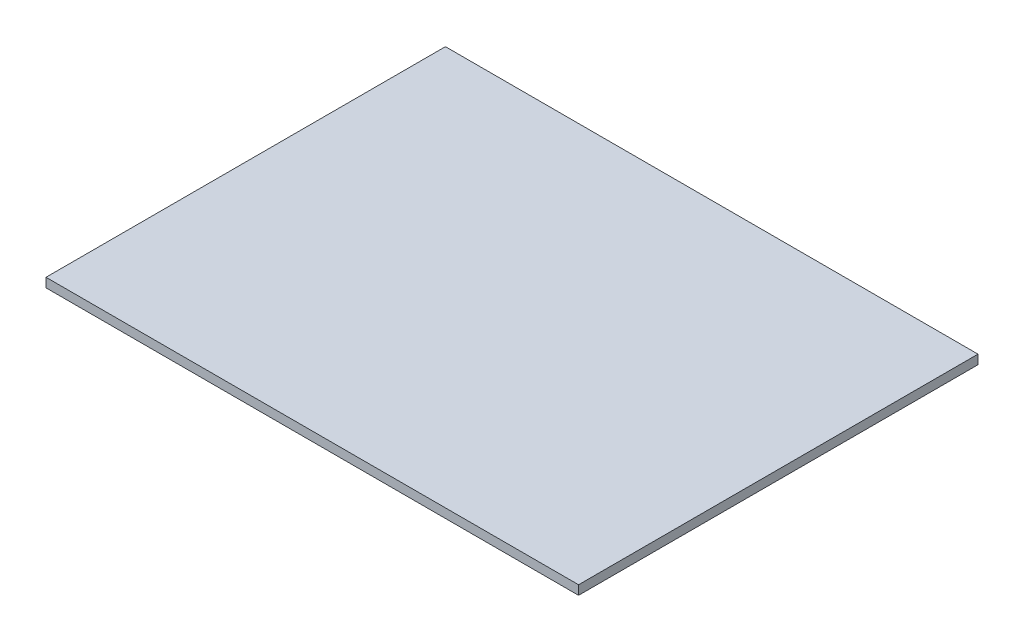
ISO-10303-21;
HEADER;
FILE_DESCRIPTION(('STEP AP214'),'2;1');
FILE_NAME('part.step','',(''),(''),'','','');
FILE_SCHEMA(('AUTOMOTIVE_DESIGN { 1 0 10303 214 1 1 1 1 }'));
ENDSEC;
DATA;
#1=APPLICATION_CONTEXT('core data for automotive mechanical design processes');
#2=APPLICATION_PROTOCOL_DEFINITION('international standard','automotive_design',2000,#1);
#3=PRODUCT_CONTEXT('',#1,'mechanical');
#4=PRODUCT('Part','Part','',(#3));
#5=PRODUCT_RELATED_PRODUCT_CATEGORY('part','',(#4));
#6=PRODUCT_DEFINITION_FORMATION('','',#4);
#7=PRODUCT_DEFINITION_CONTEXT('part definition',#1,'design');
#8=PRODUCT_DEFINITION('design','',#6,#7);
#9=PRODUCT_DEFINITION_SHAPE('','',#8);
#10=(LENGTH_UNIT() NAMED_UNIT(*) SI_UNIT(.MILLI.,.METRE.));
#11=(NAMED_UNIT(*) PLANE_ANGLE_UNIT() SI_UNIT($,.RADIAN.));
#12=(NAMED_UNIT(*) SI_UNIT($,.STERADIAN.) SOLID_ANGLE_UNIT());
#13=UNCERTAINTY_MEASURE_WITH_UNIT(LENGTH_MEASURE(1.E-05),#10,'distance_accuracy_value','');
#14=(GEOMETRIC_REPRESENTATION_CONTEXT(3) GLOBAL_UNCERTAINTY_ASSIGNED_CONTEXT((#13)) GLOBAL_UNIT_ASSIGNED_CONTEXT((#10,
#11,#12)) REPRESENTATION_CONTEXT('',''));
#15=CARTESIAN_POINT('',(0.,0.,0.));
#16=DIRECTION('',(0.,0.,1.));
#17=DIRECTION('',(1.,0.,0.));
#18=AXIS2_PLACEMENT_3D('',#15,#16,#17);
#19=CARTESIAN_POINT('',(0.,1.,0.));
#20=DIRECTION('',(1.,0.,0.));
#21=DIRECTION('',(0.,0.,-1.));
#22=AXIS2_PLACEMENT_3D('',#19,#20,#21);
#23=PLANE('',#22);
#24=DIRECTION('',(0.,0.,1.));
#25=VECTOR('',#24,1.);
#26=CARTESIAN_POINT('',(0.,0.,0.));
#27=LINE('',#26,#25);
#28=CARTESIAN_POINT('',(0.,0.,-43.5));
#29=VERTEX_POINT('',#28);
#30=CARTESIAN_POINT('',(0.,0.,0.));
#31=VERTEX_POINT('',#30);
#32=EDGE_CURVE('E96',#29,#31,#27,.T.);
#33=ORIENTED_EDGE('',*,*,#32,.T.);
#34=DIRECTION('',(0.,-1.,0.));
#35=VECTOR('',#34,1.);
#36=CARTESIAN_POINT('',(0.,1.,0.));
#37=LINE('',#36,#35);
#38=CARTESIAN_POINT('',(0.,1.,0.));
#39=VERTEX_POINT('',#38);
#40=EDGE_CURVE('E11',#39,#31,#37,.T.);
#41=ORIENTED_EDGE('',*,*,#40,.F.);
#42=DIRECTION('',(0.,0.,1.));
#43=VECTOR('',#42,1.);
#44=CARTESIAN_POINT('',(0.,1.,0.));
#45=LINE('',#44,#43);
#46=CARTESIAN_POINT('',(0.,1.,-43.5));
#47=VERTEX_POINT('',#46);
#48=EDGE_CURVE('E84',#47,#39,#45,.T.);
#49=ORIENTED_EDGE('',*,*,#48,.F.);
#50=DIRECTION('',(0.,-1.,0.));
#51=VECTOR('',#50,1.);
#52=CARTESIAN_POINT('',(0.,1.,-43.5));
#53=LINE('',#52,#51);
#54=EDGE_CURVE('E92',#47,#29,#53,.T.);
#55=ORIENTED_EDGE('',*,*,#54,.T.);
#56=EDGE_LOOP('',(#33,#41,#49,#55));
#57=FACE_BOUND('',#56,.T.);
#58=ADVANCED_FACE('F33',(#57),#23,.F.);
#59=CARTESIAN_POINT('',(0.,1.,0.));
#60=DIRECTION('',(0.,0.,-1.));
#61=DIRECTION('',(-1.,0.,0.));
#62=AXIS2_PLACEMENT_3D('',#59,#60,#61);
#63=PLANE('',#62);
#64=DIRECTION('',(1.,0.,0.));
#65=VECTOR('',#64,1.);
#66=CARTESIAN_POINT('',(0.,0.,0.));
#67=LINE('',#66,#65);
#68=CARTESIAN_POINT('',(58.,0.,0.));
#69=VERTEX_POINT('',#68);
#70=EDGE_CURVE('E88',#31,#69,#67,.T.);
#71=ORIENTED_EDGE('',*,*,#70,.T.);
#72=DIRECTION('',(0.,-1.,0.));
#73=VECTOR('',#72,1.);
#74=CARTESIAN_POINT('',(58.,1.,0.));
#75=LINE('',#74,#73);
#76=CARTESIAN_POINT('',(58.,1.,0.));
#77=VERTEX_POINT('',#76);
#78=EDGE_CURVE('E41',#77,#69,#75,.T.);
#79=ORIENTED_EDGE('',*,*,#78,.F.);
#80=DIRECTION('',(1.,0.,0.));
#81=VECTOR('',#80,1.);
#82=CARTESIAN_POINT('',(0.,1.,0.));
#83=LINE('',#82,#81);
#84=EDGE_CURVE('E79',#39,#77,#83,.T.);
#85=ORIENTED_EDGE('',*,*,#84,.F.);
#86=ORIENTED_EDGE('',*,*,#40,.T.);
#87=EDGE_LOOP('',(#71,#79,#85,#86));
#88=FACE_BOUND('',#87,.T.);
#89=ADVANCED_FACE('F87',(#88),#63,.F.);
#90=CARTESIAN_POINT('',(58.,1.,0.));
#91=DIRECTION('',(-1.,0.,0.));
#92=DIRECTION('',(0.,0.,1.));
#93=AXIS2_PLACEMENT_3D('',#90,#91,#92);
#94=PLANE('',#93);
#95=DIRECTION('',(0.,0.,-1.));
#96=VECTOR('',#95,1.);
#97=CARTESIAN_POINT('',(58.,0.,0.));
#98=LINE('',#97,#96);
#99=CARTESIAN_POINT('',(58.,0.,-43.5));
#100=VERTEX_POINT('',#99);
#101=EDGE_CURVE('E66',#69,#100,#98,.T.);
#102=ORIENTED_EDGE('',*,*,#101,.T.);
#103=DIRECTION('',(0.,-1.,0.));
#104=VECTOR('',#103,1.);
#105=CARTESIAN_POINT('',(58.,1.,-43.5));
#106=LINE('',#105,#104);
#107=CARTESIAN_POINT('',(58.,1.,-43.5));
#108=VERTEX_POINT('',#107);
#109=EDGE_CURVE('E89',#108,#100,#106,.T.);
#110=ORIENTED_EDGE('',*,*,#109,.F.);
#111=DIRECTION('',(0.,0.,-1.));
#112=VECTOR('',#111,1.);
#113=CARTESIAN_POINT('',(58.,1.,0.));
#114=LINE('',#113,#112);
#115=EDGE_CURVE('E82',#77,#108,#114,.T.);
#116=ORIENTED_EDGE('',*,*,#115,.F.);
#117=ORIENTED_EDGE('',*,*,#78,.T.);
#118=EDGE_LOOP('',(#102,#110,#116,#117));
#119=FACE_BOUND('',#118,.T.);
#120=ADVANCED_FACE('F90',(#119),#94,.F.);
#121=CARTESIAN_POINT('',(0.,1.,-43.5));
#122=DIRECTION('',(0.,0.,1.));
#123=DIRECTION('',(1.,0.,0.));
#124=AXIS2_PLACEMENT_3D('',#121,#122,#123);
#125=PLANE('',#124);
#126=DIRECTION('',(-1.,0.,0.));
#127=VECTOR('',#126,1.);
#128=CARTESIAN_POINT('',(0.,0.,-43.5));
#129=LINE('',#128,#127);
#130=EDGE_CURVE('E72',#100,#29,#129,.T.);
#131=ORIENTED_EDGE('',*,*,#130,.T.);
#132=ORIENTED_EDGE('',*,*,#54,.F.);
#133=DIRECTION('',(-1.,0.,0.));
#134=VECTOR('',#133,1.);
#135=CARTESIAN_POINT('',(0.,1.,-43.5));
#136=LINE('',#135,#134);
#137=EDGE_CURVE('E49',#108,#47,#136,.T.);
#138=ORIENTED_EDGE('',*,*,#137,.F.);
#139=ORIENTED_EDGE('',*,*,#109,.T.);
#140=EDGE_LOOP('',(#131,#132,#138,#139));
#141=FACE_BOUND('',#140,.T.);
#142=ADVANCED_FACE('F103',(#141),#125,.F.);
#143=CARTESIAN_POINT('',(0.,1.,0.));
#144=DIRECTION('',(0.,-1.,0.));
#145=DIRECTION('',(0.,0.,-1.));
#146=AXIS2_PLACEMENT_3D('',#143,#144,#145);
#147=PLANE('',#146);
#148=ORIENTED_EDGE('',*,*,#48,.T.);
#149=ORIENTED_EDGE('',*,*,#84,.T.);
#150=ORIENTED_EDGE('',*,*,#115,.T.);
#151=ORIENTED_EDGE('',*,*,#137,.T.);
#152=EDGE_LOOP('',(#148,#149,#150,#151));
#153=FACE_BOUND('',#152,.T.);
#154=ADVANCED_FACE('F80',(#153),#147,.F.);
#155=CARTESIAN_POINT('',(0.,0.,0.));
#156=DIRECTION('',(0.,-1.,0.));
#157=DIRECTION('',(0.,0.,-1.));
#158=AXIS2_PLACEMENT_3D('',#155,#156,#157);
#159=PLANE('',#158);
#160=ORIENTED_EDGE('',*,*,#32,.F.);
#161=ORIENTED_EDGE('',*,*,#130,.F.);
#162=ORIENTED_EDGE('',*,*,#101,.F.);
#163=ORIENTED_EDGE('',*,*,#70,.F.);
#164=EDGE_LOOP('',(#160,#161,#162,#163));
#165=FACE_BOUND('',#164,.T.);
#166=ADVANCED_FACE('F106',(#165),#159,.T.);
#167=CLOSED_SHELL('',(#58,#89,#120,#142,#154,#166));
#168=MANIFOLD_SOLID_BREP('B2',#167);
#169=ADVANCED_BREP_SHAPE_REPRESENTATION('',(#18,#168),#14);
#170=SHAPE_DEFINITION_REPRESENTATION(#9,#169);
ENDSEC;
END-ISO-10303-21;
